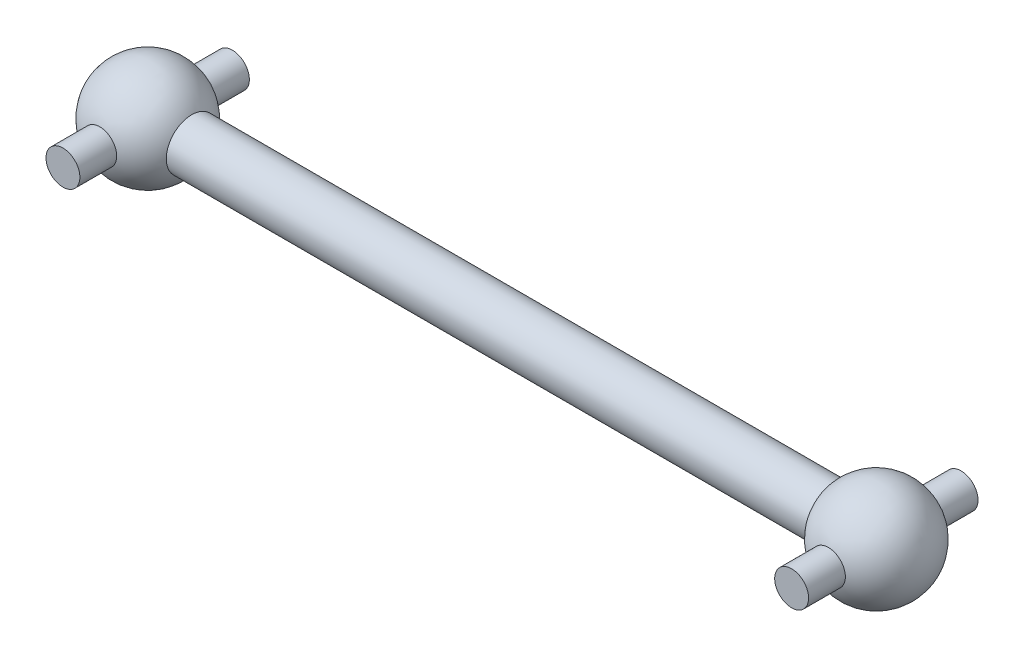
ISO-10303-21;
HEADER;
FILE_DESCRIPTION(('STEP AP214'),'2;1');
FILE_NAME('part.step','',(''),(''),'','','');
FILE_SCHEMA(('AUTOMOTIVE_DESIGN { 1 0 10303 214 1 1 1 1 }'));
ENDSEC;
DATA;
#1=APPLICATION_CONTEXT('core data for automotive mechanical design processes');
#2=APPLICATION_PROTOCOL_DEFINITION('international standard','automotive_design',2000,#1);
#3=PRODUCT_CONTEXT('',#1,'mechanical');
#4=PRODUCT('Part','Part','',(#3));
#5=PRODUCT_RELATED_PRODUCT_CATEGORY('part','',(#4));
#6=PRODUCT_DEFINITION_FORMATION('','',#4);
#7=PRODUCT_DEFINITION_CONTEXT('part definition',#1,'design');
#8=PRODUCT_DEFINITION('design','',#6,#7);
#9=PRODUCT_DEFINITION_SHAPE('','',#8);
#10=(LENGTH_UNIT() NAMED_UNIT(*) SI_UNIT(.MILLI.,.METRE.));
#11=(NAMED_UNIT(*) PLANE_ANGLE_UNIT() SI_UNIT($,.RADIAN.));
#12=(NAMED_UNIT(*) SI_UNIT($,.STERADIAN.) SOLID_ANGLE_UNIT());
#13=UNCERTAINTY_MEASURE_WITH_UNIT(LENGTH_MEASURE(1.E-05),#10,'distance_accuracy_value','');
#14=(GEOMETRIC_REPRESENTATION_CONTEXT(3) GLOBAL_UNCERTAINTY_ASSIGNED_CONTEXT((#13)) GLOBAL_UNIT_ASSIGNED_CONTEXT((#10,
#11,#12)) REPRESENTATION_CONTEXT('',''));
#15=CARTESIAN_POINT('',(0.,0.,0.));
#16=DIRECTION('',(0.,0.,1.));
#17=DIRECTION('',(1.,0.,0.));
#18=AXIS2_PLACEMENT_3D('',#15,#16,#17);
#19=CARTESIAN_POINT('',(21.5,0.,0.));
#20=DIRECTION('',(-1.,0.,0.));
#21=DIRECTION('',(0.,1.,0.));
#22=AXIS2_PLACEMENT_3D('',#19,#20,#21);
#23=SPHERICAL_SURFACE('',#22,3.);
#24=CARTESIAN_POINT('',(21.5,0.,2.82842712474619));
#25=DIRECTION('',(0.,0.,-1.));
#26=DIRECTION('',(-1.,0.,0.));
#27=AXIS2_PLACEMENT_3D('',#24,#25,#26);
#28=CIRCLE('',#27,1.);
#29=CARTESIAN_POINT('',(20.5,0.,2.82842712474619));
#30=VERTEX_POINT('',#29);
#31=EDGE_CURVE('E354',#30,#30,#28,.F.);
#32=ORIENTED_EDGE('',*,*,#31,.F.);
#33=EDGE_LOOP('',(#32));
#34=FACE_BOUND('',#33,.T.);
#35=CARTESIAN_POINT('',(18.9019237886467,0.,0.));
#36=DIRECTION('',(-1.,0.,0.));
#37=DIRECTION('',(0.,0.,1.));
#38=AXIS2_PLACEMENT_3D('',#35,#36,#37);
#39=CIRCLE('',#38,1.5);
#40=CARTESIAN_POINT('',(18.9019237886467,0.,1.5));
#41=VERTEX_POINT('',#40);
#42=EDGE_CURVE('E370',#41,#41,#39,.T.);
#43=ORIENTED_EDGE('',*,*,#42,.F.);
#44=EDGE_LOOP('',(#43));
#45=FACE_BOUND('',#44,.T.);
#46=CARTESIAN_POINT('',(21.5,0.,-2.82842712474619));
#47=DIRECTION('',(0.,0.,1.));
#48=DIRECTION('',(1.,0.,0.));
#49=AXIS2_PLACEMENT_3D('',#46,#47,#48);
#50=CIRCLE('',#49,1.);
#51=CARTESIAN_POINT('',(22.5,0.,-2.82842712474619));
#52=VERTEX_POINT('',#51);
#53=EDGE_CURVE('E10',#52,#52,#50,.F.);
#54=ORIENTED_EDGE('',*,*,#53,.F.);
#55=EDGE_LOOP('',(#54));
#56=FACE_BOUND('',#55,.T.);
#57=ADVANCED_FACE('F348',(#34,#45,#56),#23,.T.);
#58=CARTESIAN_POINT('',(-21.5,0.,0.));
#59=DIRECTION('',(-1.,0.,0.));
#60=DIRECTION('',(0.,1.,0.));
#61=AXIS2_PLACEMENT_3D('',#58,#59,#60);
#62=SPHERICAL_SURFACE('',#61,3.);
#63=CARTESIAN_POINT('',(-21.5,0.,2.82842712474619));
#64=DIRECTION('',(0.,0.,-1.));
#65=DIRECTION('',(-1.,0.,0.));
#66=AXIS2_PLACEMENT_3D('',#63,#64,#65);
#67=CIRCLE('',#66,1.);
#68=CARTESIAN_POINT('',(-22.5,0.,2.82842712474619));
#69=VERTEX_POINT('',#68);
#70=EDGE_CURVE('E362',#69,#69,#67,.F.);
#71=ORIENTED_EDGE('',*,*,#70,.F.);
#72=EDGE_LOOP('',(#71));
#73=FACE_BOUND('',#72,.T.);
#74=CARTESIAN_POINT('',(-18.9019237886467,0.,0.));
#75=DIRECTION('',(-1.,0.,0.));
#76=DIRECTION('',(0.,0.,1.));
#77=AXIS2_PLACEMENT_3D('',#74,#75,#76);
#78=CIRCLE('',#77,1.5);
#79=CARTESIAN_POINT('',(-18.9019237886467,0.,1.5));
#80=VERTEX_POINT('',#79);
#81=EDGE_CURVE('E367',#80,#80,#78,.T.);
#82=ORIENTED_EDGE('',*,*,#81,.T.);
#83=EDGE_LOOP('',(#82));
#84=FACE_BOUND('',#83,.T.);
#85=CARTESIAN_POINT('',(-21.5,0.,-2.82842712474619));
#86=DIRECTION('',(0.,0.,1.));
#87=DIRECTION('',(1.,0.,0.));
#88=AXIS2_PLACEMENT_3D('',#85,#86,#87);
#89=CIRCLE('',#88,1.);
#90=CARTESIAN_POINT('',(-20.5,0.,-2.82842712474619));
#91=VERTEX_POINT('',#90);
#92=EDGE_CURVE('E358',#91,#91,#89,.F.);
#93=ORIENTED_EDGE('',*,*,#92,.F.);
#94=EDGE_LOOP('',(#93));
#95=FACE_BOUND('',#94,.T.);
#96=ADVANCED_FACE('F398',(#73,#84,#95),#62,.T.);
#97=CARTESIAN_POINT('',(-25.7050966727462,0.,0.));
#98=DIRECTION('',(-1.,0.,0.));
#99=DIRECTION('',(0.,0.,1.));
#100=AXIS2_PLACEMENT_3D('',#97,#98,#99);
#101=CYLINDRICAL_SURFACE('',#100,1.5);
#102=ORIENTED_EDGE('',*,*,#81,.F.);
#103=EDGE_LOOP('',(#102));
#104=FACE_BOUND('',#103,.T.);
#105=ORIENTED_EDGE('',*,*,#42,.T.);
#106=EDGE_LOOP('',(#105));
#107=FACE_BOUND('',#106,.T.);
#108=ADVANCED_FACE('F403',(#104,#107),#101,.T.);
#109=CARTESIAN_POINT('',(-21.5,0.,5.));
#110=DIRECTION('',(0.,0.,1.));
#111=DIRECTION('',(1.,0.,0.));
#112=AXIS2_PLACEMENT_3D('',#109,#110,#111);
#113=PLANE('',#112);
#114=CARTESIAN_POINT('',(-21.5,0.,5.));
#115=DIRECTION('',(0.,0.,1.));
#116=DIRECTION('',(1.,0.,0.));
#117=AXIS2_PLACEMENT_3D('',#114,#115,#116);
#118=CIRCLE('',#117,1.);
#119=CARTESIAN_POINT('',(-20.5,0.,5.));
#120=VERTEX_POINT('',#119);
#121=EDGE_CURVE('E373',#120,#120,#118,.T.);
#122=ORIENTED_EDGE('',*,*,#121,.T.);
#123=EDGE_LOOP('',(#122));
#124=FACE_BOUND('',#123,.T.);
#125=ADVANCED_FACE('F410',(#124),#113,.T.);
#126=CARTESIAN_POINT('',(-21.5,0.,5.));
#127=DIRECTION('',(0.,0.,-1.));
#128=DIRECTION('',(-1.,0.,0.));
#129=AXIS2_PLACEMENT_3D('',#126,#127,#128);
#130=CYLINDRICAL_SURFACE('',#129,1.);
#131=ORIENTED_EDGE('',*,*,#121,.F.);
#132=EDGE_LOOP('',(#131));
#133=FACE_BOUND('',#132,.T.);
#134=ORIENTED_EDGE('',*,*,#70,.T.);
#135=EDGE_LOOP('',(#134));
#136=FACE_BOUND('',#135,.T.);
#137=ADVANCED_FACE('F416',(#133,#136),#130,.T.);
#138=CARTESIAN_POINT('',(-21.5,0.,-5.));
#139=DIRECTION('',(0.,0.,1.));
#140=DIRECTION('',(1.,0.,0.));
#141=AXIS2_PLACEMENT_3D('',#138,#139,#140);
#142=CIRCLE('',#141,1.);
#143=CARTESIAN_POINT('',(-20.5,0.,-5.));
#144=VERTEX_POINT('',#143);
#145=EDGE_CURVE('E376',#144,#144,#142,.T.);
#146=ORIENTED_EDGE('',*,*,#145,.T.);
#147=EDGE_LOOP('',(#146));
#148=FACE_BOUND('',#147,.T.);
#149=ORIENTED_EDGE('',*,*,#92,.T.);
#150=EDGE_LOOP('',(#149));
#151=FACE_BOUND('',#150,.T.);
#152=ADVANCED_FACE('F421',(#148,#151),#130,.T.);
#153=CARTESIAN_POINT('',(-21.5,0.,-5.));
#154=DIRECTION('',(0.,0.,1.));
#155=DIRECTION('',(1.,0.,0.));
#156=AXIS2_PLACEMENT_3D('',#153,#154,#155);
#157=PLANE('',#156);
#158=ORIENTED_EDGE('',*,*,#145,.F.);
#159=EDGE_LOOP('',(#158));
#160=FACE_BOUND('',#159,.T.);
#161=ADVANCED_FACE('F423',(#160),#157,.F.);
#162=CARTESIAN_POINT('',(21.5,0.,5.));
#163=DIRECTION('',(0.,0.,-1.));
#164=DIRECTION('',(-1.,0.,0.));
#165=AXIS2_PLACEMENT_3D('',#162,#163,#164);
#166=PLANE('',#165);
#167=CARTESIAN_POINT('',(21.5,0.,5.));
#168=DIRECTION('',(0.,0.,1.));
#169=DIRECTION('',(-1.,0.,0.));
#170=AXIS2_PLACEMENT_3D('',#167,#168,#169);
#171=CIRCLE('',#170,1.);
#172=CARTESIAN_POINT('',(20.5,0.,5.));
#173=VERTEX_POINT('',#172);
#174=EDGE_CURVE('E379',#173,#173,#171,.T.);
#175=ORIENTED_EDGE('',*,*,#174,.T.);
#176=EDGE_LOOP('',(#175));
#177=FACE_BOUND('',#176,.T.);
#178=ADVANCED_FACE('F427',(#177),#166,.F.);
#179=CARTESIAN_POINT('',(21.5,0.,5.));
#180=DIRECTION('',(0.,0.,-1.));
#181=DIRECTION('',(-1.,0.,0.));
#182=AXIS2_PLACEMENT_3D('',#179,#180,#181);
#183=CYLINDRICAL_SURFACE('',#182,1.);
#184=ORIENTED_EDGE('',*,*,#174,.F.);
#185=EDGE_LOOP('',(#184));
#186=FACE_BOUND('',#185,.T.);
#187=ORIENTED_EDGE('',*,*,#31,.T.);
#188=EDGE_LOOP('',(#187));
#189=FACE_BOUND('',#188,.T.);
#190=ADVANCED_FACE('F394',(#186,#189),#183,.T.);
#191=CARTESIAN_POINT('',(21.5,0.,-5.));
#192=DIRECTION('',(0.,0.,1.));
#193=DIRECTION('',(-1.,0.,0.));
#194=AXIS2_PLACEMENT_3D('',#191,#192,#193);
#195=CIRCLE('',#194,1.);
#196=CARTESIAN_POINT('',(20.5,0.,-5.));
#197=VERTEX_POINT('',#196);
#198=EDGE_CURVE('E382',#197,#197,#195,.T.);
#199=ORIENTED_EDGE('',*,*,#198,.T.);
#200=EDGE_LOOP('',(#199));
#201=FACE_BOUND('',#200,.T.);
#202=ORIENTED_EDGE('',*,*,#53,.T.);
#203=EDGE_LOOP('',(#202));
#204=FACE_BOUND('',#203,.T.);
#205=ADVANCED_FACE('F386',(#201,#204),#183,.T.);
#206=CARTESIAN_POINT('',(21.5,0.,-5.));
#207=DIRECTION('',(0.,0.,-1.));
#208=DIRECTION('',(-1.,0.,0.));
#209=AXIS2_PLACEMENT_3D('',#206,#207,#208);
#210=PLANE('',#209);
#211=ORIENTED_EDGE('',*,*,#198,.F.);
#212=EDGE_LOOP('',(#211));
#213=FACE_BOUND('',#212,.T.);
#214=ADVANCED_FACE('F388',(#213),#210,.T.);
#215=CLOSED_SHELL('',(#57,#96,#108,#125,#137,#152,#161,#178,#190,#205,#214));
#216=MANIFOLD_SOLID_BREP('B2',#215);
#217=ADVANCED_BREP_SHAPE_REPRESENTATION('',(#18,#216),#14);
#218=SHAPE_DEFINITION_REPRESENTATION(#9,#217);
ENDSEC;
END-ISO-10303-21;
